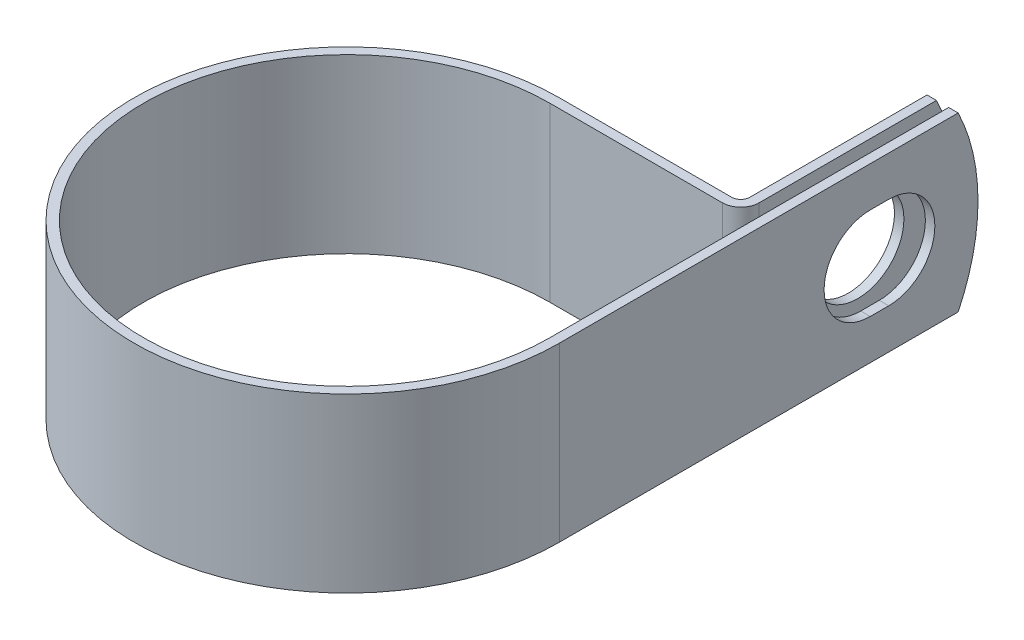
ISO-10303-21;
HEADER;
FILE_DESCRIPTION(('STEP AP214'),'2;1');
FILE_NAME('part.step','',(''),(''),'','','');
FILE_SCHEMA(('AUTOMOTIVE_DESIGN { 1 0 10303 214 1 1 1 1 }'));
ENDSEC;
DATA;
#1=APPLICATION_CONTEXT('core data for automotive mechanical design processes');
#2=APPLICATION_PROTOCOL_DEFINITION('international standard','automotive_design',2000,#1);
#3=PRODUCT_CONTEXT('',#1,'mechanical');
#4=PRODUCT('Part','Part','',(#3));
#5=PRODUCT_RELATED_PRODUCT_CATEGORY('part','',(#4));
#6=PRODUCT_DEFINITION_FORMATION('','',#4);
#7=PRODUCT_DEFINITION_CONTEXT('part definition',#1,'design');
#8=PRODUCT_DEFINITION('design','',#6,#7);
#9=PRODUCT_DEFINITION_SHAPE('','',#8);
#10=(LENGTH_UNIT() NAMED_UNIT(*) SI_UNIT(.MILLI.,.METRE.));
#11=(NAMED_UNIT(*) PLANE_ANGLE_UNIT() SI_UNIT($,.RADIAN.));
#12=(NAMED_UNIT(*) SI_UNIT($,.STERADIAN.) SOLID_ANGLE_UNIT());
#13=UNCERTAINTY_MEASURE_WITH_UNIT(LENGTH_MEASURE(1.E-05),#10,'distance_accuracy_value','');
#14=(GEOMETRIC_REPRESENTATION_CONTEXT(3) GLOBAL_UNCERTAINTY_ASSIGNED_CONTEXT((#13)) GLOBAL_UNIT_ASSIGNED_CONTEXT((#10,
#11,#12)) REPRESENTATION_CONTEXT('',''));
#15=CARTESIAN_POINT('',(0.,0.,0.));
#16=DIRECTION('',(0.,0.,1.));
#17=DIRECTION('',(1.,0.,0.));
#18=AXIS2_PLACEMENT_3D('',#15,#16,#17);
#19=CARTESIAN_POINT('',(26.1874,11.1125,0.));
#20=DIRECTION('',(-1.,0.,0.));
#21=DIRECTION('',(0.,0.,1.));
#22=AXIS2_PLACEMENT_3D('',#19,#20,#21);
#23=PLANE('',#22);
#24=DIRECTION('',(0.,0.,-1.));
#25=VECTOR('',#24,1.);
#26=CARTESIAN_POINT('',(26.1874,-5.9436,-40.0811999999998));
#27=LINE('',#26,#25);
#28=CARTESIAN_POINT('',(26.1874,-5.9436,-40.0811999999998));
#29=VERTEX_POINT('',#28);
#30=CARTESIAN_POINT('',(26.1874,-5.9436,-42.4688000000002));
#31=VERTEX_POINT('',#30);
#32=EDGE_CURVE('E236',#29,#31,#27,.T.);
#33=ORIENTED_EDGE('',*,*,#32,.T.);
#34=CARTESIAN_POINT('',(26.1874,0.,-42.4687999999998));
#35=DIRECTION('',(-1.,0.,0.));
#36=DIRECTION('',(0.,0.,1.));
#37=AXIS2_PLACEMENT_3D('',#34,#35,#36);
#38=CIRCLE('',#37,5.9436);
#39=CARTESIAN_POINT('',(26.1874,5.9436,-42.4688000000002));
#40=VERTEX_POINT('',#39);
#41=EDGE_CURVE('E257',#31,#40,#38,.F.);
#42=ORIENTED_EDGE('',*,*,#41,.T.);
#43=DIRECTION('',(0.,0.,1.));
#44=VECTOR('',#43,1.);
#45=CARTESIAN_POINT('',(26.1874,5.9436,-40.0811999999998));
#46=LINE('',#45,#44);
#47=CARTESIAN_POINT('',(26.1874,5.9436,-40.0811999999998));
#48=VERTEX_POINT('',#47);
#49=EDGE_CURVE('E253',#40,#48,#46,.T.);
#50=ORIENTED_EDGE('',*,*,#49,.T.);
#51=CARTESIAN_POINT('',(26.1874,0.,-40.0811999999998));
#52=DIRECTION('',(-1.,0.,0.));
#53=DIRECTION('',(0.,0.,1.));
#54=AXIS2_PLACEMENT_3D('',#51,#52,#53);
#55=CIRCLE('',#54,5.9436);
#56=EDGE_CURVE('E248',#48,#29,#55,.F.);
#57=ORIENTED_EDGE('',*,*,#56,.T.);
#58=EDGE_LOOP('',(#33,#42,#50,#57));
#59=FACE_BOUND('',#58,.T.);
#60=CARTESIAN_POINT('',(26.1874,0.,-28.575));
#61=DIRECTION('',(-1.,0.,0.));
#62=DIRECTION('',(0.,0.,1.));
#63=AXIS2_PLACEMENT_3D('',#60,#61,#62);
#64=CIRCLE('',#63,25.4);
#65=CARTESIAN_POINT('',(26.1874,11.1125,-51.4151476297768));
#66=VERTEX_POINT('',#65);
#67=CARTESIAN_POINT('',(26.1874,-11.1125,-51.4151476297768));
#68=VERTEX_POINT('',#67);
#69=EDGE_CURVE('E75',#66,#68,#64,.T.);
#70=ORIENTED_EDGE('',*,*,#69,.T.);
#71=DIRECTION('',(0.,0.,-1.));
#72=VECTOR('',#71,1.);
#73=CARTESIAN_POINT('',(26.1874,-11.1125,0.));
#74=LINE('',#73,#72);
#75=CARTESIAN_POINT('',(26.1874,-11.1125,0.));
#76=VERTEX_POINT('',#75);
#77=EDGE_CURVE('E271',#76,#68,#74,.T.);
#78=ORIENTED_EDGE('',*,*,#77,.F.);
#79=DIRECTION('',(0.,-1.,0.));
#80=VECTOR('',#79,1.);
#81=CARTESIAN_POINT('',(26.1874,11.1125,0.));
#82=LINE('',#81,#80);
#83=CARTESIAN_POINT('',(26.1874,11.1125,0.));
#84=VERTEX_POINT('',#83);
#85=EDGE_CURVE('E218',#84,#76,#82,.T.);
#86=ORIENTED_EDGE('',*,*,#85,.F.);
#87=DIRECTION('',(0.,0.,-1.));
#88=VECTOR('',#87,1.);
#89=CARTESIAN_POINT('',(26.1874,11.1125,-26.1874));
#90=LINE('',#89,#88);
#91=EDGE_CURVE('E273',#84,#66,#90,.T.);
#92=ORIENTED_EDGE('',*,*,#91,.T.);
#93=EDGE_LOOP('',(#70,#78,#86,#92));
#94=FACE_BOUND('',#93,.T.);
#95=ADVANCED_FACE('F54',(#59,#94),#23,.T.);
#96=CARTESIAN_POINT('',(24.6126,11.1125,-53.975));
#97=DIRECTION('',(1.,0.,0.));
#98=DIRECTION('',(0.,0.,-1.));
#99=AXIS2_PLACEMENT_3D('',#96,#97,#98);
#100=PLANE('',#99);
#101=CARTESIAN_POINT('',(24.6126,0.,-41.275));
#102=DIRECTION('',(1.,0.,0.));
#103=DIRECTION('',(0.,0.,-1.));
#104=AXIS2_PLACEMENT_3D('',#101,#102,#103);
#105=CIRCLE('',#104,5.9436);
#106=CARTESIAN_POINT('',(24.6126,0.,-47.2186));
#107=VERTEX_POINT('',#106);
#108=EDGE_CURVE('E268',#107,#107,#105,.F.);
#109=ORIENTED_EDGE('',*,*,#108,.T.);
#110=EDGE_LOOP('',(#109));
#111=FACE_BOUND('',#110,.T.);
#112=DIRECTION('',(0.,0.,1.));
#113=VECTOR('',#112,1.);
#114=CARTESIAN_POINT('',(24.6126,-11.1125,-53.975));
#115=LINE('',#114,#113);
#116=CARTESIAN_POINT('',(24.6126,-11.1125,-51.4151476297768));
#117=VERTEX_POINT('',#116);
#118=CARTESIAN_POINT('',(24.6126,-11.1125,-28.56484));
#119=VERTEX_POINT('',#118);
#120=EDGE_CURVE('E184',#117,#119,#115,.T.);
#121=ORIENTED_EDGE('',*,*,#120,.F.);
#122=CARTESIAN_POINT('',(24.6126,0.,-28.575));
#123=DIRECTION('',(1.,0.,0.));
#124=DIRECTION('',(0.,0.,-1.));
#125=AXIS2_PLACEMENT_3D('',#122,#123,#124);
#126=CIRCLE('',#125,25.4);
#127=CARTESIAN_POINT('',(24.6126,11.1125,-51.4151476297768));
#128=VERTEX_POINT('',#127);
#129=EDGE_CURVE('E176',#117,#128,#126,.T.);
#130=ORIENTED_EDGE('',*,*,#129,.T.);
#131=DIRECTION('',(0.,0.,1.));
#132=VECTOR('',#131,1.);
#133=CARTESIAN_POINT('',(24.6126,11.1125,-53.975));
#134=LINE('',#133,#132);
#135=CARTESIAN_POINT('',(24.6126,11.1125,-28.56484));
#136=VERTEX_POINT('',#135);
#137=EDGE_CURVE('E224',#128,#136,#134,.T.);
#138=ORIENTED_EDGE('',*,*,#137,.T.);
#139=DIRECTION('',(0.,-1.,0.));
#140=VECTOR('',#139,1.);
#141=CARTESIAN_POINT('',(24.6126,11.1125,-28.56484));
#142=LINE('',#141,#140);
#143=EDGE_CURVE('E211',#136,#119,#142,.T.);
#144=ORIENTED_EDGE('',*,*,#143,.T.);
#145=EDGE_LOOP('',(#121,#130,#138,#144));
#146=FACE_BOUND('',#145,.T.);
#147=ADVANCED_FACE('F226',(#111,#146),#100,.T.);
#148=CARTESIAN_POINT('',(23.3934,11.1125,-53.975));
#149=DIRECTION('',(1.,0.,0.));
#150=DIRECTION('',(0.,0.,-1.));
#151=AXIS2_PLACEMENT_3D('',#148,#149,#150);
#152=PLANE('',#151);
#153=CARTESIAN_POINT('',(23.3934,0.,-41.275));
#154=DIRECTION('',(-1.,0.,0.));
#155=DIRECTION('',(0.,0.,1.));
#156=AXIS2_PLACEMENT_3D('',#153,#154,#155);
#157=CIRCLE('',#156,5.9436);
#158=CARTESIAN_POINT('',(23.3934,0.,-35.3314));
#159=VERTEX_POINT('',#158);
#160=EDGE_CURVE('E265',#159,#159,#157,.T.);
#161=ORIENTED_EDGE('',*,*,#160,.F.);
#162=EDGE_LOOP('',(#161));
#163=FACE_BOUND('',#162,.T.);
#164=CARTESIAN_POINT('',(23.3934,0.,-28.575));
#165=DIRECTION('',(-1.,0.,0.));
#166=DIRECTION('',(0.,0.,1.));
#167=AXIS2_PLACEMENT_3D('',#164,#165,#166);
#168=CIRCLE('',#167,25.4);
#169=CARTESIAN_POINT('',(23.3934,11.1125,-51.4151476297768));
#170=VERTEX_POINT('',#169);
#171=CARTESIAN_POINT('',(23.3934,-11.1125,-51.4151476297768));
#172=VERTEX_POINT('',#171);
#173=EDGE_CURVE('E67',#170,#172,#168,.T.);
#174=ORIENTED_EDGE('',*,*,#173,.T.);
#175=DIRECTION('',(0.,0.,1.));
#176=VECTOR('',#175,1.);
#177=CARTESIAN_POINT('',(23.3934,-11.1125,-53.975));
#178=LINE('',#177,#176);
#179=CARTESIAN_POINT('',(23.3934,-11.1125,-28.56484));
#180=VERTEX_POINT('',#179);
#181=EDGE_CURVE('E167',#172,#180,#178,.T.);
#182=ORIENTED_EDGE('',*,*,#181,.T.);
#183=DIRECTION('',(0.,-1.,0.));
#184=VECTOR('',#183,1.);
#185=CARTESIAN_POINT('',(23.3934,11.1125,-28.56484));
#186=LINE('',#185,#184);
#187=CARTESIAN_POINT('',(23.3934,11.1125,-28.56484));
#188=VERTEX_POINT('',#187);
#189=EDGE_CURVE('E209',#188,#180,#186,.T.);
#190=ORIENTED_EDGE('',*,*,#189,.F.);
#191=DIRECTION('',(0.,0.,1.));
#192=VECTOR('',#191,1.);
#193=CARTESIAN_POINT('',(23.3934,11.1125,-53.975));
#194=LINE('',#193,#192);
#195=EDGE_CURVE('E169',#170,#188,#194,.T.);
#196=ORIENTED_EDGE('',*,*,#195,.F.);
#197=EDGE_LOOP('',(#174,#182,#190,#196));
#198=FACE_BOUND('',#197,.T.);
#199=ADVANCED_FACE('F164',(#163,#198),#152,.F.);
#200=CARTESIAN_POINT('',(27.4066,11.1125,0.));
#201=DIRECTION('',(-1.,0.,0.));
#202=DIRECTION('',(0.,0.,1.));
#203=AXIS2_PLACEMENT_3D('',#200,#201,#202);
#204=PLANE('',#203);
#205=CARTESIAN_POINT('',(27.4066,0.,-42.4687999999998));
#206=DIRECTION('',(1.,0.,0.));
#207=DIRECTION('',(0.,0.,-1.));
#208=AXIS2_PLACEMENT_3D('',#205,#206,#207);
#209=CIRCLE('',#208,5.9436);
#210=CARTESIAN_POINT('',(27.4066,-5.9436,-42.4688000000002));
#211=VERTEX_POINT('',#210);
#212=CARTESIAN_POINT('',(27.4066,5.9436,-42.4688000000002));
#213=VERTEX_POINT('',#212);
#214=EDGE_CURVE('E237',#211,#213,#209,.T.);
#215=ORIENTED_EDGE('',*,*,#214,.F.);
#216=DIRECTION('',(0.,0.,-1.));
#217=VECTOR('',#216,1.);
#218=CARTESIAN_POINT('',(27.4066,-5.9436,-40.0811999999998));
#219=LINE('',#218,#217);
#220=CARTESIAN_POINT('',(27.4066,-5.9436,-40.0811999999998));
#221=VERTEX_POINT('',#220);
#222=EDGE_CURVE('E240',#221,#211,#219,.T.);
#223=ORIENTED_EDGE('',*,*,#222,.F.);
#224=CARTESIAN_POINT('',(27.4066,0.,-40.0811999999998));
#225=DIRECTION('',(1.,0.,0.));
#226=DIRECTION('',(0.,0.,-1.));
#227=AXIS2_PLACEMENT_3D('',#224,#225,#226);
#228=CIRCLE('',#227,5.9436);
#229=CARTESIAN_POINT('',(27.4066,5.9436,-40.0811999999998));
#230=VERTEX_POINT('',#229);
#231=EDGE_CURVE('E230',#230,#221,#228,.T.);
#232=ORIENTED_EDGE('',*,*,#231,.F.);
#233=DIRECTION('',(0.,0.,1.));
#234=VECTOR('',#233,1.);
#235=CARTESIAN_POINT('',(27.4066,5.9436,-40.0811999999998));
#236=LINE('',#235,#234);
#237=EDGE_CURVE('E234',#213,#230,#236,.T.);
#238=ORIENTED_EDGE('',*,*,#237,.F.);
#239=EDGE_LOOP('',(#215,#223,#232,#238));
#240=FACE_BOUND('',#239,.T.);
#241=DIRECTION('',(0.,0.,-1.));
#242=VECTOR('',#241,1.);
#243=CARTESIAN_POINT('',(27.4066,-11.1125,0.));
#244=LINE('',#243,#242);
#245=CARTESIAN_POINT('',(27.4066,-11.1125,0.));
#246=VERTEX_POINT('',#245);
#247=CARTESIAN_POINT('',(27.4066,-11.1125,-51.4151476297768));
#248=VERTEX_POINT('',#247);
#249=EDGE_CURVE('E195',#246,#248,#244,.T.);
#250=ORIENTED_EDGE('',*,*,#249,.T.);
#251=CARTESIAN_POINT('',(27.4066,0.,-28.575));
#252=DIRECTION('',(-1.,0.,0.));
#253=DIRECTION('',(0.,0.,1.));
#254=AXIS2_PLACEMENT_3D('',#251,#252,#253);
#255=CIRCLE('',#254,25.4);
#256=CARTESIAN_POINT('',(27.4066,11.1125,-51.4151476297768));
#257=VERTEX_POINT('',#256);
#258=EDGE_CURVE('E170',#257,#248,#255,.T.);
#259=ORIENTED_EDGE('',*,*,#258,.F.);
#260=DIRECTION('',(0.,0.,-1.));
#261=VECTOR('',#260,1.);
#262=CARTESIAN_POINT('',(27.4066,11.1125,-26.1874));
#263=LINE('',#262,#261);
#264=CARTESIAN_POINT('',(27.4066,11.1125,0.));
#265=VERTEX_POINT('',#264);
#266=EDGE_CURVE('E198',#265,#257,#263,.T.);
#267=ORIENTED_EDGE('',*,*,#266,.F.);
#268=DIRECTION('',(0.,-1.,0.));
#269=VECTOR('',#268,1.);
#270=CARTESIAN_POINT('',(27.4066,11.1125,0.));
#271=LINE('',#270,#269);
#272=EDGE_CURVE('E199',#265,#246,#271,.T.);
#273=ORIENTED_EDGE('',*,*,#272,.T.);
#274=EDGE_LOOP('',(#250,#259,#267,#273));
#275=FACE_BOUND('',#274,.T.);
#276=ADVANCED_FACE('F321',(#240,#275),#204,.F.);
#277=CARTESIAN_POINT('',(0.,-11.1125,0.));
#278=DIRECTION('',(0.,1.,0.));
#279=DIRECTION('',(1.,0.,0.));
#280=AXIS2_PLACEMENT_3D('',#277,#278,#279);
#281=PLANE('',#280);
#282=DIRECTION('',(-1.,0.,0.));
#283=VECTOR('',#282,1.);
#284=CARTESIAN_POINT('',(27.4066,-11.1125,-51.4151476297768));
#285=LINE('',#284,#283);
#286=EDGE_CURVE('E171',#248,#68,#285,.T.);
#287=ORIENTED_EDGE('',*,*,#286,.F.);
#288=ORIENTED_EDGE('',*,*,#249,.F.);
#289=CARTESIAN_POINT('',(0.,-11.1125,0.));
#290=DIRECTION('',(0.,1.,0.));
#291=DIRECTION('',(1.,0.,0.));
#292=AXIS2_PLACEMENT_3D('',#289,#290,#291);
#293=CIRCLE('',#292,27.4066);
#294=CARTESIAN_POINT('',(0.,-11.1125,-27.4066));
#295=VERTEX_POINT('',#294);
#296=EDGE_CURVE('E193',#295,#246,#293,.T.);
#297=ORIENTED_EDGE('',*,*,#296,.F.);
#298=DIRECTION('',(1.,0.,0.));
#299=VECTOR('',#298,1.);
#300=CARTESIAN_POINT('',(0.,-11.1125,-27.4066));
#301=LINE('',#300,#299);
#302=CARTESIAN_POINT('',(22.23516,-11.1125,-27.4066));
#303=VERTEX_POINT('',#302);
#304=EDGE_CURVE('E186',#303,#295,#301,.F.);
#305=ORIENTED_EDGE('',*,*,#304,.F.);
#306=CARTESIAN_POINT('',(22.23516,-11.1125,-28.56484));
#307=DIRECTION('',(0.,1.,0.));
#308=DIRECTION('',(1.,0.,0.));
#309=AXIS2_PLACEMENT_3D('',#306,#307,#308);
#310=CIRCLE('',#309,1.15824);
#311=EDGE_CURVE('E183',#180,#303,#310,.F.);
#312=ORIENTED_EDGE('',*,*,#311,.F.);
#313=ORIENTED_EDGE('',*,*,#181,.F.);
#314=DIRECTION('',(-1.,0.,0.));
#315=VECTOR('',#314,1.);
#316=CARTESIAN_POINT('',(27.4066,-11.1125,-51.4151476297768));
#317=LINE('',#316,#315);
#318=EDGE_CURVE('E12',#117,#172,#317,.T.);
#319=ORIENTED_EDGE('',*,*,#318,.F.);
#320=ORIENTED_EDGE('',*,*,#120,.T.);
#321=CARTESIAN_POINT('',(22.23516,-11.1125,-28.56484));
#322=DIRECTION('',(0.,-1.,0.));
#323=DIRECTION('',(0.,0.,1.));
#324=AXIS2_PLACEMENT_3D('',#321,#322,#323);
#325=CIRCLE('',#324,2.37744);
#326=CARTESIAN_POINT('',(22.23516,-11.1125,-26.1874));
#327=VERTEX_POINT('',#326);
#328=EDGE_CURVE('E188',#119,#327,#325,.T.);
#329=ORIENTED_EDGE('',*,*,#328,.T.);
#330=DIRECTION('',(-1.,0.,0.));
#331=VECTOR('',#330,1.);
#332=CARTESIAN_POINT('',(0.,-11.1125,-26.1874));
#333=LINE('',#332,#331);
#334=CARTESIAN_POINT('',(0.,-11.1125,-26.1874));
#335=VERTEX_POINT('',#334);
#336=EDGE_CURVE('E298',#327,#335,#333,.T.);
#337=ORIENTED_EDGE('',*,*,#336,.T.);
#338=CARTESIAN_POINT('',(0.,-11.1125,0.));
#339=DIRECTION('',(0.,1.,0.));
#340=DIRECTION('',(0.,0.,1.));
#341=AXIS2_PLACEMENT_3D('',#338,#339,#340);
#342=CIRCLE('',#341,26.1874);
#343=EDGE_CURVE('E295',#335,#76,#342,.T.);
#344=ORIENTED_EDGE('',*,*,#343,.T.);
#345=ORIENTED_EDGE('',*,*,#77,.T.);
#346=EDGE_LOOP('',(#287,#288,#297,#305,#312,#313,#319,#320,#329,#337,#344,#345));
#347=FACE_BOUND('',#346,.T.);
#348=ADVANCED_FACE('F181',(#347),#281,.F.);
#349=CARTESIAN_POINT('',(0.,11.1125,0.));
#350=DIRECTION('',(0.,1.,0.));
#351=DIRECTION('',(1.,0.,0.));
#352=AXIS2_PLACEMENT_3D('',#349,#350,#351);
#353=PLANE('',#352);
#354=ORIENTED_EDGE('',*,*,#266,.T.);
#355=DIRECTION('',(-1.,0.,0.));
#356=VECTOR('',#355,1.);
#357=CARTESIAN_POINT('',(27.4066,11.1125,-51.4151476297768));
#358=LINE('',#357,#356);
#359=EDGE_CURVE('E228',#257,#66,#358,.T.);
#360=ORIENTED_EDGE('',*,*,#359,.T.);
#361=ORIENTED_EDGE('',*,*,#91,.F.);
#362=CARTESIAN_POINT('',(0.,11.1125,0.));
#363=DIRECTION('',(0.,1.,0.));
#364=DIRECTION('',(0.,0.,1.));
#365=AXIS2_PLACEMENT_3D('',#362,#363,#364);
#366=CIRCLE('',#365,26.1874);
#367=CARTESIAN_POINT('',(0.,11.1125,-26.1874));
#368=VERTEX_POINT('',#367);
#369=EDGE_CURVE('E276',#368,#84,#366,.T.);
#370=ORIENTED_EDGE('',*,*,#369,.F.);
#371=DIRECTION('',(-1.,0.,0.));
#372=VECTOR('',#371,1.);
#373=CARTESIAN_POINT('',(0.,11.1125,-26.1874));
#374=LINE('',#373,#372);
#375=CARTESIAN_POINT('',(22.23516,11.1125,-26.1874));
#376=VERTEX_POINT('',#375);
#377=EDGE_CURVE('E279',#376,#368,#374,.T.);
#378=ORIENTED_EDGE('',*,*,#377,.F.);
#379=CARTESIAN_POINT('',(22.23516,11.1125,-28.56484));
#380=DIRECTION('',(0.,-1.,0.));
#381=DIRECTION('',(0.,0.,1.));
#382=AXIS2_PLACEMENT_3D('',#379,#380,#381);
#383=CIRCLE('',#382,2.37744);
#384=EDGE_CURVE('E282',#136,#376,#383,.T.);
#385=ORIENTED_EDGE('',*,*,#384,.F.);
#386=ORIENTED_EDGE('',*,*,#137,.F.);
#387=DIRECTION('',(-1.,0.,0.));
#388=VECTOR('',#387,1.);
#389=CARTESIAN_POINT('',(27.4066,11.1125,-51.4151476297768));
#390=LINE('',#389,#388);
#391=EDGE_CURVE('E61',#128,#170,#390,.T.);
#392=ORIENTED_EDGE('',*,*,#391,.T.);
#393=ORIENTED_EDGE('',*,*,#195,.T.);
#394=CARTESIAN_POINT('',(22.23516,11.1125,-28.56484));
#395=DIRECTION('',(0.,1.,0.));
#396=DIRECTION('',(1.,0.,0.));
#397=AXIS2_PLACEMENT_3D('',#394,#395,#396);
#398=CIRCLE('',#397,1.15824);
#399=CARTESIAN_POINT('',(22.23516,11.1125,-27.4066));
#400=VERTEX_POINT('',#399);
#401=EDGE_CURVE('E287',#188,#400,#398,.F.);
#402=ORIENTED_EDGE('',*,*,#401,.T.);
#403=DIRECTION('',(1.,0.,0.));
#404=VECTOR('',#403,1.);
#405=CARTESIAN_POINT('',(0.,11.1125,-27.4066));
#406=LINE('',#405,#404);
#407=CARTESIAN_POINT('',(0.,11.1125,-27.4066));
#408=VERTEX_POINT('',#407);
#409=EDGE_CURVE('E289',#400,#408,#406,.F.);
#410=ORIENTED_EDGE('',*,*,#409,.T.);
#411=CARTESIAN_POINT('',(0.,11.1125,0.));
#412=DIRECTION('',(0.,1.,0.));
#413=DIRECTION('',(1.,0.,0.));
#414=AXIS2_PLACEMENT_3D('',#411,#412,#413);
#415=CIRCLE('',#414,27.4066);
#416=EDGE_CURVE('E203',#408,#265,#415,.T.);
#417=ORIENTED_EDGE('',*,*,#416,.T.);
#418=EDGE_LOOP('',(#354,#360,#361,#370,#378,#385,#386,#392,#393,#402,#410,#417));
#419=FACE_BOUND('',#418,.T.);
#420=ADVANCED_FACE('F222',(#419),#353,.T.);
#421=CARTESIAN_POINT('',(0.,11.1125,0.));
#422=DIRECTION('',(0.,-1.,0.));
#423=DIRECTION('',(0.,0.,-1.));
#424=AXIS2_PLACEMENT_3D('',#421,#422,#423);
#425=CYLINDRICAL_SURFACE('',#424,26.1874);
#426=ORIENTED_EDGE('',*,*,#343,.F.);
#427=DIRECTION('',(0.,-1.,0.));
#428=VECTOR('',#427,1.);
#429=CARTESIAN_POINT('',(0.,11.1125,-26.1874));
#430=LINE('',#429,#428);
#431=EDGE_CURVE('E216',#368,#335,#430,.T.);
#432=ORIENTED_EDGE('',*,*,#431,.F.);
#433=ORIENTED_EDGE('',*,*,#369,.T.);
#434=ORIENTED_EDGE('',*,*,#85,.T.);
#435=EDGE_LOOP('',(#426,#432,#433,#434));
#436=FACE_BOUND('',#435,.T.);
#437=ADVANCED_FACE('F311',(#436),#425,.F.);
#438=CARTESIAN_POINT('',(0.,11.1125,-26.1874));
#439=DIRECTION('',(0.,0.,1.));
#440=DIRECTION('',(1.,0.,0.));
#441=AXIS2_PLACEMENT_3D('',#438,#439,#440);
#442=PLANE('',#441);
#443=ORIENTED_EDGE('',*,*,#336,.F.);
#444=DIRECTION('',(0.,-1.,0.));
#445=VECTOR('',#444,1.);
#446=CARTESIAN_POINT('',(22.23516,11.1125,-26.1874));
#447=LINE('',#446,#445);
#448=EDGE_CURVE('E214',#376,#327,#447,.T.);
#449=ORIENTED_EDGE('',*,*,#448,.F.);
#450=ORIENTED_EDGE('',*,*,#377,.T.);
#451=ORIENTED_EDGE('',*,*,#431,.T.);
#452=EDGE_LOOP('',(#443,#449,#450,#451));
#453=FACE_BOUND('',#452,.T.);
#454=ADVANCED_FACE('F307',(#453),#442,.T.);
#455=CARTESIAN_POINT('',(22.23516,11.1125,-28.56484));
#456=DIRECTION('',(0.,-1.,0.));
#457=DIRECTION('',(0.,0.,-1.));
#458=AXIS2_PLACEMENT_3D('',#455,#456,#457);
#459=CYLINDRICAL_SURFACE('',#458,2.37744);
#460=ORIENTED_EDGE('',*,*,#328,.F.);
#461=ORIENTED_EDGE('',*,*,#143,.F.);
#462=ORIENTED_EDGE('',*,*,#384,.T.);
#463=ORIENTED_EDGE('',*,*,#448,.T.);
#464=EDGE_LOOP('',(#460,#461,#462,#463));
#465=FACE_BOUND('',#464,.T.);
#466=ADVANCED_FACE('F304',(#465),#459,.T.);
#467=CARTESIAN_POINT('',(22.23516,11.1125,-28.56484));
#468=DIRECTION('',(0.,-1.,0.));
#469=DIRECTION('',(0.,0.,-1.));
#470=AXIS2_PLACEMENT_3D('',#467,#468,#469);
#471=CYLINDRICAL_SURFACE('',#470,1.15824);
#472=ORIENTED_EDGE('',*,*,#311,.T.);
#473=DIRECTION('',(0.,-1.,0.));
#474=VECTOR('',#473,1.);
#475=CARTESIAN_POINT('',(22.23516,11.1125,-27.4066));
#476=LINE('',#475,#474);
#477=EDGE_CURVE('E206',#400,#303,#476,.T.);
#478=ORIENTED_EDGE('',*,*,#477,.F.);
#479=ORIENTED_EDGE('',*,*,#401,.F.);
#480=ORIENTED_EDGE('',*,*,#189,.T.);
#481=EDGE_LOOP('',(#472,#478,#479,#480));
#482=FACE_BOUND('',#481,.T.);
#483=ADVANCED_FACE('F334',(#482),#471,.F.);
#484=CARTESIAN_POINT('',(0.,11.1125,-27.4066));
#485=DIRECTION('',(0.,0.,1.));
#486=DIRECTION('',(1.,0.,0.));
#487=AXIS2_PLACEMENT_3D('',#484,#485,#486);
#488=PLANE('',#487);
#489=ORIENTED_EDGE('',*,*,#304,.T.);
#490=DIRECTION('',(0.,-1.,0.));
#491=VECTOR('',#490,1.);
#492=CARTESIAN_POINT('',(0.,11.1125,-27.4066));
#493=LINE('',#492,#491);
#494=EDGE_CURVE('E202',#408,#295,#493,.T.);
#495=ORIENTED_EDGE('',*,*,#494,.F.);
#496=ORIENTED_EDGE('',*,*,#409,.F.);
#497=ORIENTED_EDGE('',*,*,#477,.T.);
#498=EDGE_LOOP('',(#489,#495,#496,#497));
#499=FACE_BOUND('',#498,.T.);
#500=ADVANCED_FACE('F330',(#499),#488,.F.);
#501=CARTESIAN_POINT('',(0.,11.1125,0.));
#502=DIRECTION('',(0.,-1.,0.));
#503=DIRECTION('',(0.,0.,-1.));
#504=AXIS2_PLACEMENT_3D('',#501,#502,#503);
#505=CYLINDRICAL_SURFACE('',#504,27.4066);
#506=ORIENTED_EDGE('',*,*,#296,.T.);
#507=ORIENTED_EDGE('',*,*,#272,.F.);
#508=ORIENTED_EDGE('',*,*,#416,.F.);
#509=ORIENTED_EDGE('',*,*,#494,.T.);
#510=EDGE_LOOP('',(#506,#507,#508,#509));
#511=FACE_BOUND('',#510,.T.);
#512=ADVANCED_FACE('F327',(#511),#505,.T.);
#513=CARTESIAN_POINT('',(41.4236394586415,0.,-41.275));
#514=DIRECTION('',(-1.,0.,0.));
#515=DIRECTION('',(0.,0.,1.));
#516=AXIS2_PLACEMENT_3D('',#513,#514,#515);
#517=CYLINDRICAL_SURFACE('',#516,5.9436);
#518=ORIENTED_EDGE('',*,*,#160,.T.);
#519=EDGE_LOOP('',(#518));
#520=FACE_BOUND('',#519,.T.);
#521=ORIENTED_EDGE('',*,*,#108,.F.);
#522=EDGE_LOOP('',(#521));
#523=FACE_BOUND('',#522,.T.);
#524=ADVANCED_FACE('F379',(#520,#523),#517,.F.);
#525=CARTESIAN_POINT('',(7.61119374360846,-5.9436,-40.0811999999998));
#526=DIRECTION('',(0.,-1.,0.));
#527=DIRECTION('',(0.,0.,-1.));
#528=AXIS2_PLACEMENT_3D('',#525,#526,#527);
#529=PLANE('',#528);
#530=DIRECTION('',(1.,0.,0.));
#531=VECTOR('',#530,1.);
#532=CARTESIAN_POINT('',(7.61119374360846,-5.9436,-40.0811999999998));
#533=LINE('',#532,#531);
#534=EDGE_CURVE('E251',#29,#221,#533,.T.);
#535=ORIENTED_EDGE('',*,*,#534,.T.);
#536=ORIENTED_EDGE('',*,*,#222,.T.);
#537=DIRECTION('',(1.,0.,0.));
#538=VECTOR('',#537,1.);
#539=CARTESIAN_POINT('',(7.61119374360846,-5.9436,-42.4688000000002));
#540=LINE('',#539,#538);
#541=EDGE_CURVE('E247',#31,#211,#540,.T.);
#542=ORIENTED_EDGE('',*,*,#541,.F.);
#543=ORIENTED_EDGE('',*,*,#32,.F.);
#544=EDGE_LOOP('',(#535,#536,#542,#543));
#545=FACE_BOUND('',#544,.T.);
#546=ADVANCED_FACE('F354',(#545),#529,.F.);
#547=CARTESIAN_POINT('',(7.61119374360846,0.,-42.4687999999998));
#548=DIRECTION('',(1.,0.,0.));
#549=DIRECTION('',(0.,0.,-1.));
#550=AXIS2_PLACEMENT_3D('',#547,#548,#549);
#551=CYLINDRICAL_SURFACE('',#550,5.9436);
#552=ORIENTED_EDGE('',*,*,#541,.T.);
#553=ORIENTED_EDGE('',*,*,#214,.T.);
#554=DIRECTION('',(1.,0.,0.));
#555=VECTOR('',#554,1.);
#556=CARTESIAN_POINT('',(7.61119374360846,5.9436,-42.4688000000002));
#557=LINE('',#556,#555);
#558=EDGE_CURVE('E256',#40,#213,#557,.T.);
#559=ORIENTED_EDGE('',*,*,#558,.F.);
#560=ORIENTED_EDGE('',*,*,#41,.F.);
#561=EDGE_LOOP('',(#552,#553,#559,#560));
#562=FACE_BOUND('',#561,.T.);
#563=ADVANCED_FACE('F358',(#562),#551,.F.);
#564=CARTESIAN_POINT('',(7.61119374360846,5.9436,-40.0811999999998));
#565=DIRECTION('',(0.,1.,0.));
#566=DIRECTION('',(0.,0.,1.));
#567=AXIS2_PLACEMENT_3D('',#564,#565,#566);
#568=PLANE('',#567);
#569=ORIENTED_EDGE('',*,*,#558,.T.);
#570=ORIENTED_EDGE('',*,*,#237,.T.);
#571=DIRECTION('',(1.,0.,0.));
#572=VECTOR('',#571,1.);
#573=CARTESIAN_POINT('',(7.61119374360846,5.9436,-40.0811999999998));
#574=LINE('',#573,#572);
#575=EDGE_CURVE('E252',#48,#230,#574,.T.);
#576=ORIENTED_EDGE('',*,*,#575,.F.);
#577=ORIENTED_EDGE('',*,*,#49,.F.);
#578=EDGE_LOOP('',(#569,#570,#576,#577));
#579=FACE_BOUND('',#578,.T.);
#580=ADVANCED_FACE('F362',(#579),#568,.F.);
#581=CARTESIAN_POINT('',(7.61119374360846,0.,-40.0811999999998));
#582=DIRECTION('',(1.,0.,0.));
#583=DIRECTION('',(0.,0.,-1.));
#584=AXIS2_PLACEMENT_3D('',#581,#582,#583);
#585=CYLINDRICAL_SURFACE('',#584,5.9436);
#586=ORIENTED_EDGE('',*,*,#575,.T.);
#587=ORIENTED_EDGE('',*,*,#231,.T.);
#588=ORIENTED_EDGE('',*,*,#534,.F.);
#589=ORIENTED_EDGE('',*,*,#56,.F.);
#590=EDGE_LOOP('',(#586,#587,#588,#589));
#591=FACE_BOUND('',#590,.T.);
#592=ADVANCED_FACE('F366',(#591),#585,.F.);
#593=CARTESIAN_POINT('',(27.4066,0.,-28.575));
#594=DIRECTION('',(-1.,0.,0.));
#595=DIRECTION('',(0.,0.,1.));
#596=AXIS2_PLACEMENT_3D('',#593,#594,#595);
#597=CYLINDRICAL_SURFACE('',#596,25.4);
#598=ORIENTED_EDGE('',*,*,#129,.F.);
#599=ORIENTED_EDGE('',*,*,#318,.T.);
#600=ORIENTED_EDGE('',*,*,#173,.F.);
#601=ORIENTED_EDGE('',*,*,#391,.F.);
#602=EDGE_LOOP('',(#598,#599,#600,#601));
#603=FACE_BOUND('',#602,.T.);
#604=ADVANCED_FACE('F174',(#603),#597,.T.);
#605=ORIENTED_EDGE('',*,*,#359,.F.);
#606=ORIENTED_EDGE('',*,*,#258,.T.);
#607=ORIENTED_EDGE('',*,*,#286,.T.);
#608=ORIENTED_EDGE('',*,*,#69,.F.);
#609=EDGE_LOOP('',(#605,#606,#607,#608));
#610=FACE_BOUND('',#609,.T.);
#611=ADVANCED_FACE('F316',(#610),#597,.T.);
#612=CLOSED_SHELL('',(#95,#147,#199,#276,#348,#420,#437,#454,#466,#483,#500,#512,#524,#546,#563,
#580,#592,#604,#611));
#613=MANIFOLD_SOLID_BREP('B2',#612);
#614=ADVANCED_BREP_SHAPE_REPRESENTATION('',(#18,#613),#14);
#615=SHAPE_DEFINITION_REPRESENTATION(#9,#614);
ENDSEC;
END-ISO-10303-21;
